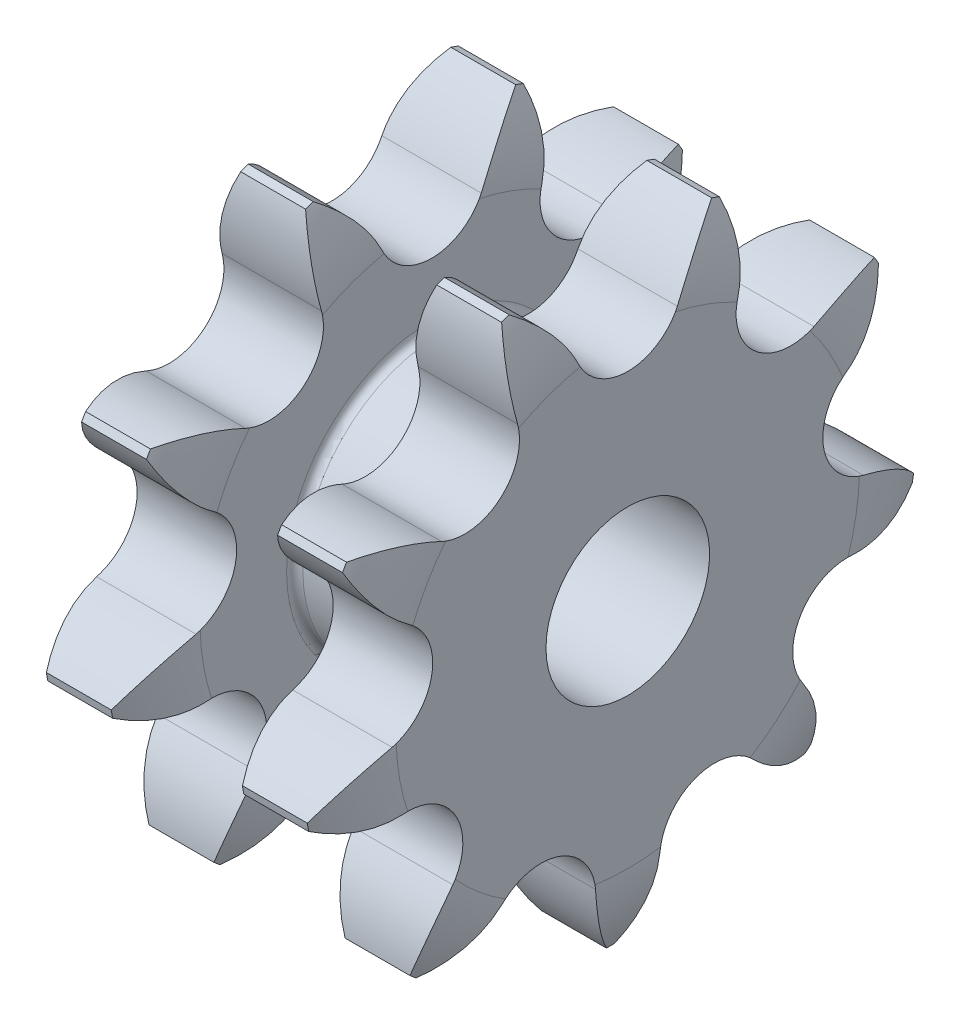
from build123d import *

# Parameters (mm, degrees)
TOOTHCUT_DEPTH  = 39.537037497
TEETHCUTS_COUNT = 9
TEETHCUTS_ANGLE = 320
BORSKE_R        = 6
BORE_DEPTH      = 23.8805


with BuildPart() as part:
    # BasProSke → Base-Revolve (revolve)
    with BuildSketch(Plane(origin=(0, 0, 0), x_dir=(1, 0, 0), z_dir=(0, 1, 0)), mode=Mode.PRIVATE) as base_revolve_sk:
        with BuildLine():
            Line((0, 0), (0, 16.992856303))
            ThreePointArc((0, 16.992856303), (0.321571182, 19.832662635), (1.27, 22.528657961))
            Line((1.27, 22.528657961), (20.41, 22.528657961))
            ThreePointArc((20.41, 22.528657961), (21.358428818, 19.832662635), (21.68, 16.992856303))
            Line((21.68, 16.992856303), (21.68, 0))
            Line((21.68, 0), (0, 0))
        make_face()
    revolve(base_revolve_sk.sketch.rotate(Axis((-10, 0, 0), (1, 0, 0)), 180), axis=Axis((-10, 0, 0), (1, 0, 0)))

    # GrvSke → Groove (revolve, cut)
    with BuildSketch(Plane(origin=(0, 0, 0), x_dir=(1, 0, 0), z_dir=(0, 1, 0)), mode=Mode.PRIVATE) as groove_sk:
        with BuildLine():
            Line((7.3, 16.992856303), (7.3, 10.646481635))
            ThreePointArc((7.3, 10.646481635), (7.475735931, 10.222217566), (7.9, 10.046481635))
            Line((7.9, 10.046481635), (13.78, 10.046481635))
            ThreePointArc((13.78, 10.046481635), (14.204264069, 10.222217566), (14.38, 10.646481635))
            Line((14.38, 10.646481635), (14.38, 16.992856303))
            ThreePointArc((14.38, 16.992856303), (14.701571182, 19.832662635), (15.65, 22.528657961))
            Line((15.65, 22.528657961), (6.03, 22.528657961))
            ThreePointArc((6.03, 22.528657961), (6.978428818, 19.832662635), (7.3, 16.992856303))
        make_face()
    revolve(groove_sk.sketch.rotate(Axis((0, 0, 0), (1, 0, 0)), 180), axis=Axis((0, 0, 0), (1, 0, 0)), mode=Mode.SUBTRACT)

    # TooCutSke → ToothCut (cut, through all)
    with BuildSketch(Plane(origin=(0, 0, 0), x_dir=(0, 0, -1), z_dir=(1, 0, 0))):
        with BuildLine():
            ThreePointArc((3.638599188, 16.909201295), (5.440645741, 19.594585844), (7.97480479, 21.603739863))
            ThreePointArc((7.97480479, 21.603739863), (0, 23.028657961), (-7.97480479, 21.603739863))
            ThreePointArc((-7.97480479, 21.603739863), (-5.440645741, 19.594585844), (-3.638599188, 16.909201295))
            ThreePointArc((-3.638599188, 16.909201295), (0, 14.591157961), (3.638599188, 16.909201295))
        make_face()
    toothcut = extrude(amount=TOOTHCUT_DEPTH, mode=Mode.SUBTRACT)

    # TeethCuts: ToothCut ×9 about axis
    teethcuts_axis = Axis((-10, 0, 0), (1, 0, 0))
    for i in range(1, TEETHCUTS_COUNT):
        add(toothcut.rotate(teethcuts_axis, i * TEETHCUTS_ANGLE / (TEETHCUTS_COUNT - 1)), mode=Mode.SUBTRACT)

    # BorSke → Bore (cut, symmetric)
    with BuildSketch(Plane(origin=(0, 0, 0), x_dir=(0, 0, -1), z_dir=(1, 0, 0))):
        with Locations(Location((0, 0, 0), (0, 0, 180))):
            Circle(BORSKE_R)
    extrude(amount=BORE_DEPTH, both=True, mode=Mode.SUBTRACT)


solid = part.part
